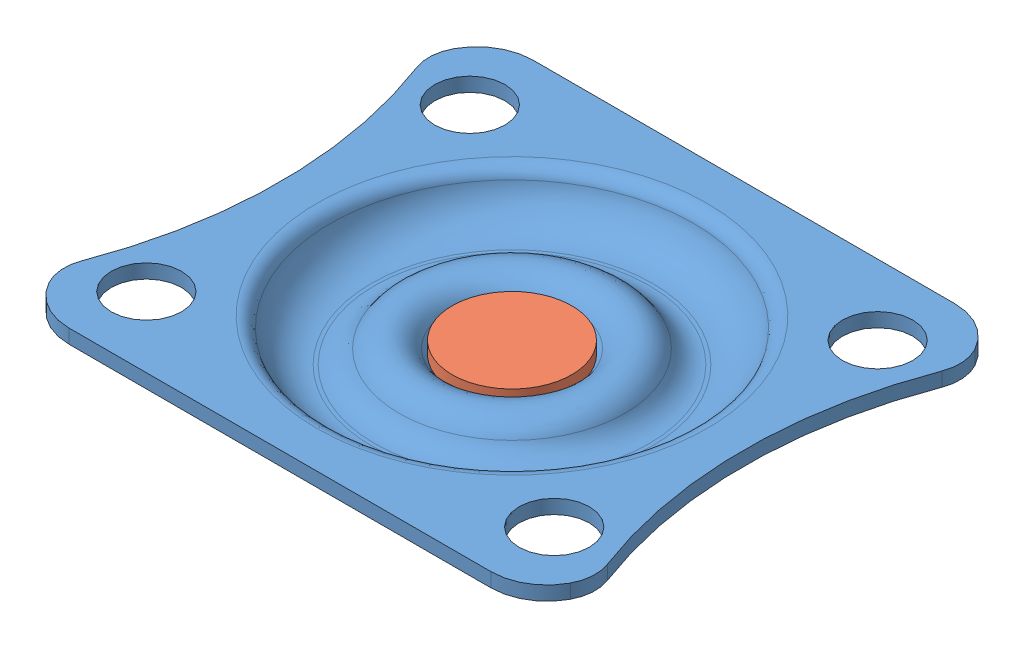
SolidWorks assembly A - Base.SLDASM, configuration Défaut (file format 14000). Lengths in mm.
Overall size (37.76 8 33).
3 component instances, 3 part files, 4 mates.
Components (placement in the parent):
- Base-1: Base.SLDPRT [Défaut] at (-1.008 2.021 37.7647) size (37.76 4 33)
- Rivet A-1: Rivet A.SLDPRT [Défaut] at (-1.008 -0.979 37.7647) size (8.5 5.5 8.5)
- Rivet B-1: Rivet B.SLDPRT [Défaut] at (-1.008 -3.979 37.7647) size (10.5 5 10.5)
Mates (geometry in assembly coordinates):
- Coaxiale1: concentric aligned: cylinder of Base-1 through (-1.008 7.3947 37.7647) axis (0 1 0) radius 1.5; cylinder of Rivet A-1 through (-1.008 2.4333 37.7647) axis (0 1 0) radius 1.5
- Coïncidente1: coincident anti-aligned: plane of Base-1 through (-3.8298 -0.979 37.7647) normal (0 1 0); plane of Rivet A-1 through (-5.258 -0.979 37.7647) normal (0 -1 0)
- Coaxiale2: concentric aligned: cylinder of Rivet A-1 through (-1.008 2.4333 37.7647) axis (0 1 0) radius 1.5; cylinder of Rivet B-1 through (-1.008 23.2913 37.7647) axis (0 1 0) radius 1.5
- Distance1: distance = 2 mm anti-aligned: plane of Base-1 through (-3.8298 -1.979 37.7647) normal (0 -1 0); plane of Rivet B-1 through (-6.258 -3.979 37.7647) normal (0 1 0)
